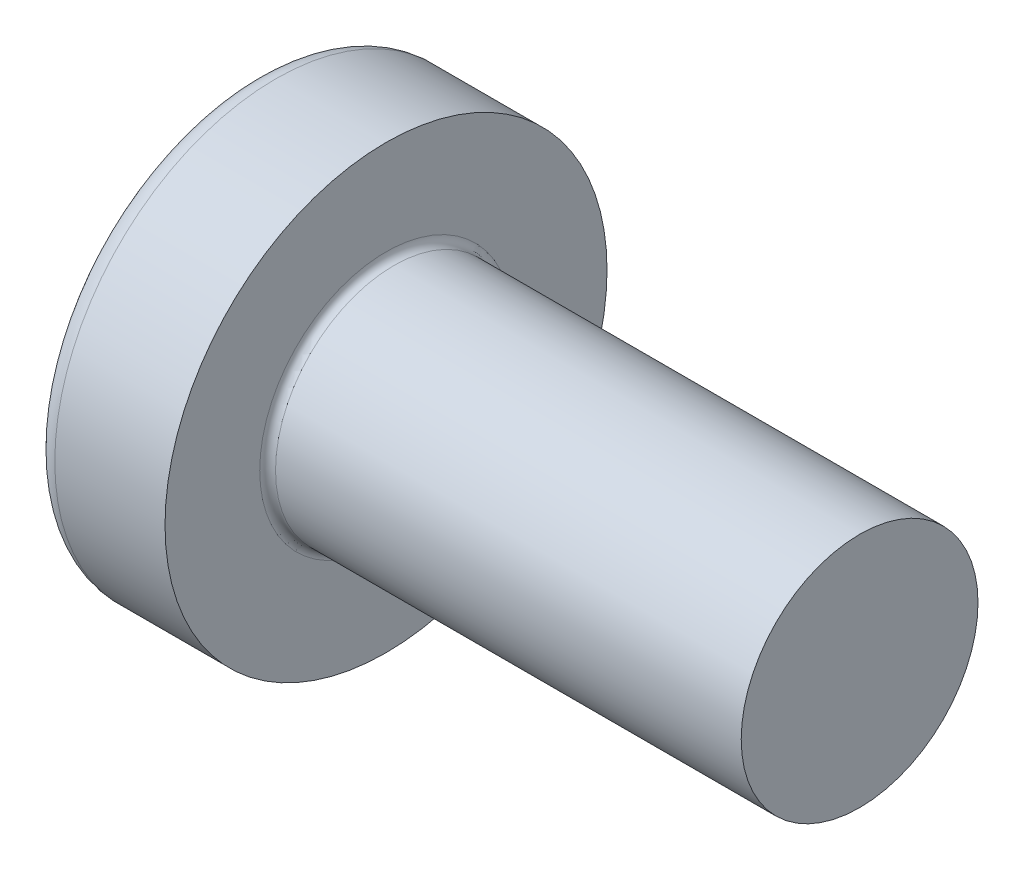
ISO-10303-21;
HEADER;
FILE_DESCRIPTION(('STEP AP214'),'2;1');
FILE_NAME('part.step','',(''),(''),'','','');
FILE_SCHEMA(('AUTOMOTIVE_DESIGN { 1 0 10303 214 1 1 1 1 }'));
ENDSEC;
DATA;
#1=APPLICATION_CONTEXT('core data for automotive mechanical design processes');
#2=APPLICATION_PROTOCOL_DEFINITION('international standard','automotive_design',2000,#1);
#3=PRODUCT_CONTEXT('',#1,'mechanical');
#4=PRODUCT('Part','Part','',(#3));
#5=PRODUCT_RELATED_PRODUCT_CATEGORY('part','',(#4));
#6=PRODUCT_DEFINITION_FORMATION('','',#4);
#7=PRODUCT_DEFINITION_CONTEXT('part definition',#1,'design');
#8=PRODUCT_DEFINITION('design','',#6,#7);
#9=PRODUCT_DEFINITION_SHAPE('','',#8);
#10=(LENGTH_UNIT() NAMED_UNIT(*) SI_UNIT(.MILLI.,.METRE.));
#11=(NAMED_UNIT(*) PLANE_ANGLE_UNIT() SI_UNIT($,.RADIAN.));
#12=(NAMED_UNIT(*) SI_UNIT($,.STERADIAN.) SOLID_ANGLE_UNIT());
#13=UNCERTAINTY_MEASURE_WITH_UNIT(LENGTH_MEASURE(1.E-05),#10,'distance_accuracy_value','');
#14=(GEOMETRIC_REPRESENTATION_CONTEXT(3) GLOBAL_UNCERTAINTY_ASSIGNED_CONTEXT((#13)) GLOBAL_UNIT_ASSIGNED_CONTEXT((#10,
#11,#12)) REPRESENTATION_CONTEXT('',''));
#15=CARTESIAN_POINT('',(0.,0.,0.));
#16=DIRECTION('',(0.,0.,1.));
#17=DIRECTION('',(1.,0.,0.));
#18=AXIS2_PLACEMENT_3D('',#15,#16,#17);
#19=CARTESIAN_POINT('',(5.,0.,0.));
#20=DIRECTION('',(-1.,0.,0.));
#21=DIRECTION('',(0.,1.,0.));
#22=AXIS2_PLACEMENT_3D('',#19,#20,#21);
#23=SPHERICAL_SURFACE('',#22,5.);
#24=CARTESIAN_POINT('',(0.775371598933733,0.,0.));
#25=DIRECTION('',(-1.,0.,0.));
#26=DIRECTION('',(0.,0.,1.));
#27=AXIS2_PLACEMENT_3D('',#24,#25,#26);
#28=CIRCLE('',#27,2.67441860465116);
#29=CARTESIAN_POINT('',(0.775371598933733,0.,2.67441860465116));
#30=VERTEX_POINT('',#29);
#31=EDGE_CURVE('E237',#30,#30,#28,.T.);
#32=ORIENTED_EDGE('',*,*,#31,.T.);
#33=EDGE_LOOP('',(#32));
#34=FACE_BOUND('',#33,.T.);
#35=CARTESIAN_POINT('',(0.0457951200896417,0.,0.));
#36=DIRECTION('',(1.,0.,0.));
#37=DIRECTION('',(0.,0.,-1.));
#38=AXIS2_PLACEMENT_3D('',#35,#36,#37);
#39=CIRCLE('',#38,0.675169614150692);
#40=CARTESIAN_POINT('',(0.0457951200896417,-0.369999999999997,-0.564760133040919));
#41=VERTEX_POINT('',#40);
#42=CARTESIAN_POINT('',(0.0457951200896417,-0.564760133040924,-0.37));
#43=VERTEX_POINT('',#42);
#44=EDGE_CURVE('E373',#41,#43,#39,.F.);
#45=ORIENTED_EDGE('',*,*,#44,.F.);
#46=CARTESIAN_POINT('',(5.,-0.370000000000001,0.));
#47=DIRECTION('',(0.,1.,0.));
#48=DIRECTION('',(0.,0.,1.));
#49=AXIS2_PLACEMENT_3D('',#46,#47,#48);
#50=CIRCLE('',#49,4.98629120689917);
#51=CARTESIAN_POINT('',(0.187869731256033,-0.369999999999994,-1.30633161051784));
#52=VERTEX_POINT('',#51);
#53=EDGE_CURVE('E299',#52,#41,#50,.T.);
#54=ORIENTED_EDGE('',*,*,#53,.F.);
#55=CARTESIAN_POINT('',(4.56358245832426,0.,0.87531820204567));
#56=DIRECTION('',(0.446197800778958,0.,-0.89493436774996));
#57=DIRECTION('',(-0.89493436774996,0.,-0.446197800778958));
#58=AXIS2_PLACEMENT_3D('',#55,#56,#57);
#59=CIRCLE('',#58,4.90340267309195);
#60=CARTESIAN_POINT('',(0.187869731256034,0.370000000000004,-1.30633161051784));
#61=VERTEX_POINT('',#60);
#62=EDGE_CURVE('E271',#52,#61,#59,.T.);
#63=ORIENTED_EDGE('',*,*,#62,.T.);
#64=CARTESIAN_POINT('',(5.,0.37,0.));
#65=DIRECTION('',(0.,-1.,0.));
#66=DIRECTION('',(0.,0.,-1.));
#67=AXIS2_PLACEMENT_3D('',#64,#65,#66);
#68=CIRCLE('',#67,4.98629120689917);
#69=CARTESIAN_POINT('',(0.0457951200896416,0.370000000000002,-0.564760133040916));
#70=VERTEX_POINT('',#69);
#71=EDGE_CURVE('E326',#70,#61,#68,.T.);
#72=ORIENTED_EDGE('',*,*,#71,.F.);
#73=CARTESIAN_POINT('',(0.0457951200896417,0.564760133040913,-0.37));
#74=VERTEX_POINT('',#73);
#75=EDGE_CURVE('E392',#74,#70,#39,.F.);
#76=ORIENTED_EDGE('',*,*,#75,.F.);
#77=CARTESIAN_POINT('',(5.,0.,-0.37));
#78=DIRECTION('',(0.,0.,1.));
#79=DIRECTION('',(0.,-1.,0.));
#80=AXIS2_PLACEMENT_3D('',#77,#78,#79);
#81=CIRCLE('',#80,4.98629120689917);
#82=CARTESIAN_POINT('',(0.187869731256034,1.30633161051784,-0.37));
#83=VERTEX_POINT('',#82);
#84=EDGE_CURVE('E265',#83,#74,#81,.T.);
#85=ORIENTED_EDGE('',*,*,#84,.F.);
#86=CARTESIAN_POINT('',(4.56358245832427,-0.87531820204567,0.));
#87=DIRECTION('',(0.446197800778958,0.89493436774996,0.));
#88=DIRECTION('',(-0.89493436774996,0.446197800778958,0.));
#89=AXIS2_PLACEMENT_3D('',#86,#87,#88);
#90=CIRCLE('',#89,4.90340267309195);
#91=CARTESIAN_POINT('',(0.187869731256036,1.30633161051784,0.37));
#92=VERTEX_POINT('',#91);
#93=EDGE_CURVE('E268',#83,#92,#90,.T.);
#94=ORIENTED_EDGE('',*,*,#93,.T.);
#95=CARTESIAN_POINT('',(5.,0.,0.370000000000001));
#96=DIRECTION('',(0.,0.,-1.));
#97=DIRECTION('',(-1.,0.,0.));
#98=AXIS2_PLACEMENT_3D('',#95,#96,#97);
#99=CIRCLE('',#98,4.98629120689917);
#100=CARTESIAN_POINT('',(0.0457951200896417,0.564760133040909,0.369999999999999));
#101=VERTEX_POINT('',#100);
#102=EDGE_CURVE('E261',#101,#92,#99,.T.);
#103=ORIENTED_EDGE('',*,*,#102,.F.);
#104=CARTESIAN_POINT('',(0.0457951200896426,0.369999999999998,0.564760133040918));
#105=VERTEX_POINT('',#104);
#106=EDGE_CURVE('E391',#105,#101,#39,.F.);
#107=ORIENTED_EDGE('',*,*,#106,.F.);
#108=CARTESIAN_POINT('',(0.187869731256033,0.369999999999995,1.30633161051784));
#109=VERTEX_POINT('',#108);
#110=EDGE_CURVE('E281',#109,#105,#68,.T.);
#111=ORIENTED_EDGE('',*,*,#110,.F.);
#112=CARTESIAN_POINT('',(4.56358245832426,0.,-0.875318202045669));
#113=DIRECTION('',(0.446197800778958,0.,0.89493436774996));
#114=DIRECTION('',(0.89493436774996,0.,-0.446197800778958));
#115=AXIS2_PLACEMENT_3D('',#112,#113,#114);
#116=CIRCLE('',#115,4.90340267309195);
#117=CARTESIAN_POINT('',(0.187869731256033,-0.370000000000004,1.30633161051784));
#118=VERTEX_POINT('',#117);
#119=EDGE_CURVE('E48',#109,#118,#116,.T.);
#120=ORIENTED_EDGE('',*,*,#119,.T.);
#121=CARTESIAN_POINT('',(0.0457951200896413,-0.370000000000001,0.564760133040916));
#122=VERTEX_POINT('',#121);
#123=EDGE_CURVE('E278',#122,#118,#50,.T.);
#124=ORIENTED_EDGE('',*,*,#123,.F.);
#125=CARTESIAN_POINT('',(0.0457951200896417,-0.56476013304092,0.369999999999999));
#126=VERTEX_POINT('',#125);
#127=EDGE_CURVE('E431',#126,#122,#39,.F.);
#128=ORIENTED_EDGE('',*,*,#127,.F.);
#129=CARTESIAN_POINT('',(0.187869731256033,-1.30633161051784,0.369999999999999));
#130=VERTEX_POINT('',#129);
#131=EDGE_CURVE('E262',#130,#126,#99,.T.);
#132=ORIENTED_EDGE('',*,*,#131,.F.);
#133=CARTESIAN_POINT('',(4.56358245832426,0.875318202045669,0.));
#134=DIRECTION('',(0.446197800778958,-0.89493436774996,0.));
#135=DIRECTION('',(0.89493436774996,0.446197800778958,0.));
#136=AXIS2_PLACEMENT_3D('',#133,#134,#135);
#137=CIRCLE('',#136,4.90340267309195);
#138=CARTESIAN_POINT('',(0.187869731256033,-1.30633161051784,-0.37));
#139=VERTEX_POINT('',#138);
#140=EDGE_CURVE('E258',#130,#139,#137,.T.);
#141=ORIENTED_EDGE('',*,*,#140,.T.);
#142=EDGE_CURVE('E63',#43,#139,#81,.T.);
#143=ORIENTED_EDGE('',*,*,#142,.F.);
#144=EDGE_LOOP('',(#45,#54,#63,#72,#76,#85,#94,#103,#107,#111,#120,#124,#128,#132,#141,#143));
#145=FACE_BOUND('',#144,.T.);
#146=ADVANCED_FACE('F34',(#34,#145),#23,.T.);
#147=CARTESIAN_POINT('',(1.75,0.527482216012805,-0.37));
#148=DIRECTION('',(0.,0.,1.));
#149=DIRECTION('',(0.,-1.,0.));
#150=AXIS2_PLACEMENT_3D('',#147,#148,#149);
#151=PLANE('',#150);
#152=ORIENTED_EDGE('',*,*,#84,.T.);
#153=CARTESIAN_POINT('',(-0.987293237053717,0.649401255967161,-0.37));
#154=CARTESIAN_POINT('',(-0.781914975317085,0.632865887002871,-0.37));
#155=CARTESIAN_POINT('',(-0.576547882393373,0.616188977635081,-0.37));
#156=CARTESIAN_POINT('',(-0.165841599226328,0.582441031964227,-0.37));
#157=CARTESIAN_POINT('',(0.0394975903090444,0.56536998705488,-0.37));
#158=CARTESIAN_POINT('',(0.450133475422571,0.530723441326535,-0.37));
#159=CARTESIAN_POINT('',(0.655430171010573,0.513147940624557,-0.37));
#160=CARTESIAN_POINT('',(1.06596140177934,0.477314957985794,-0.37));
#161=CARTESIAN_POINT('',(1.2711959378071,0.459057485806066,-0.37));
#162=CARTESIAN_POINT('',(1.61065292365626,0.428051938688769,-0.37));
#163=CARTESIAN_POINT('',(1.74490059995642,0.415580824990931,-0.37));
#164=CARTESIAN_POINT('',(2.01334321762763,0.390092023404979,-0.37));
#165=CARTESIAN_POINT('',(2.14753815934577,0.377074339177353,-0.37));
#166=CARTESIAN_POINT('',(2.41586354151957,0.350315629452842,-0.37));
#167=CARTESIAN_POINT('',(2.5499939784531,0.33657456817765,-0.37));
#168=CARTESIAN_POINT('',(2.81814173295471,0.308004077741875,-0.37));
#169=CARTESIAN_POINT('',(2.95215904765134,0.293174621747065,-0.37));
#170=CARTESIAN_POINT('',(3.0860955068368,0.277618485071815,-0.37));
#171=B_SPLINE_CURVE_WITH_KNOTS('',3,(#153,#154,#155,#156,#157,#158,#159,#160,#161,#162,#163,
#164,#165,#166,#167,#168,#169,#170),.UNSPECIFIED.,.F.,.F.,(4,2,2,2,2,2,2,2,4),(0.,
0.618128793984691,1.23627109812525,1.85441325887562,2.4725465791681,2.87702276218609,
3.28149623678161,3.68598973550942,4.09049321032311),.UNSPECIFIED.);
#172=CARTESIAN_POINT('',(1.75,0.415013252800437,-0.370000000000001));
#173=VERTEX_POINT('',#172);
#174=EDGE_CURVE('E415',#74,#173,#171,.T.);
#175=ORIENTED_EDGE('',*,*,#174,.T.);
#176=DIRECTION('',(0.,1.,0.));
#177=VECTOR('',#176,1.);
#178=CARTESIAN_POINT('',(1.75,-0.527482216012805,-0.37));
#179=LINE('',#178,#177);
#180=CARTESIAN_POINT('',(1.75,0.527482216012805,-0.37));
#181=VERTEX_POINT('',#180);
#182=EDGE_CURVE('E355',#173,#181,#179,.T.);
#183=ORIENTED_EDGE('',*,*,#182,.T.);
#184=DIRECTION('',(0.89493436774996,-0.446197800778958,0.));
#185=VECTOR('',#184,1.);
#186=CARTESIAN_POINT('',(0.,1.4,-0.37));
#187=LINE('',#186,#185);
#188=EDGE_CURVE('E238',#83,#181,#187,.T.);
#189=ORIENTED_EDGE('',*,*,#188,.F.);
#190=EDGE_LOOP('',(#152,#175,#183,#189));
#191=FACE_BOUND('',#190,.T.);
#192=ADVANCED_FACE('F193',(#191),#151,.T.);
#193=CARTESIAN_POINT('',(1.75,-0.527482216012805,-0.37));
#194=VERTEX_POINT('',#193);
#195=CARTESIAN_POINT('',(1.75,-0.415013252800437,-0.37));
#196=VERTEX_POINT('',#195);
#197=EDGE_CURVE('E246',#194,#196,#179,.T.);
#198=ORIENTED_EDGE('',*,*,#197,.T.);
#199=CARTESIAN_POINT('',(-0.987293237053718,-0.649401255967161,-0.37));
#200=CARTESIAN_POINT('',(-0.781914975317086,-0.632865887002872,-0.37));
#201=CARTESIAN_POINT('',(-0.576547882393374,-0.616188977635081,-0.37));
#202=CARTESIAN_POINT('',(-0.165841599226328,-0.582441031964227,-0.37));
#203=CARTESIAN_POINT('',(0.0394975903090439,-0.56536998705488,-0.37));
#204=CARTESIAN_POINT('',(0.450133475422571,-0.530723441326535,-0.37));
#205=CARTESIAN_POINT('',(0.655430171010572,-0.513147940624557,-0.37));
#206=CARTESIAN_POINT('',(1.06596140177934,-0.477314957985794,-0.37));
#207=CARTESIAN_POINT('',(1.2711959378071,-0.459057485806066,-0.37));
#208=CARTESIAN_POINT('',(1.61065292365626,-0.428051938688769,-0.37));
#209=CARTESIAN_POINT('',(1.74490059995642,-0.415580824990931,-0.37));
#210=CARTESIAN_POINT('',(2.01334321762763,-0.39009202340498,-0.37));
#211=CARTESIAN_POINT('',(2.14753815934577,-0.377074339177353,-0.37));
#212=CARTESIAN_POINT('',(2.41586354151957,-0.350315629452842,-0.37));
#213=CARTESIAN_POINT('',(2.5499939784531,-0.33657456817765,-0.37));
#214=CARTESIAN_POINT('',(2.81814173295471,-0.308004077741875,-0.37));
#215=CARTESIAN_POINT('',(2.95215904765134,-0.293174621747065,-0.37));
#216=CARTESIAN_POINT('',(3.0860955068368,-0.277618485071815,-0.37));
#217=B_SPLINE_CURVE_WITH_KNOTS('',3,(#199,#200,#201,#202,#203,#204,#205,#206,#207,#208,#209,
#210,#211,#212,#213,#214,#215,#216),.UNSPECIFIED.,.F.,.F.,(4,2,2,2,2,2,2,2,4),(0.,
0.618128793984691,1.23627109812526,1.85441325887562,2.4725465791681,2.87702276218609,
3.28149623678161,3.68598973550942,4.09049321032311),.UNSPECIFIED.);
#218=EDGE_CURVE('E390',#196,#43,#217,.F.);
#219=ORIENTED_EDGE('',*,*,#218,.T.);
#220=ORIENTED_EDGE('',*,*,#142,.T.);
#221=DIRECTION('',(0.89493436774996,0.446197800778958,0.));
#222=VECTOR('',#221,1.);
#223=CARTESIAN_POINT('',(0.,-1.4,-0.37));
#224=LINE('',#223,#222);
#225=EDGE_CURVE('E329',#139,#194,#224,.T.);
#226=ORIENTED_EDGE('',*,*,#225,.T.);
#227=EDGE_LOOP('',(#198,#219,#220,#226));
#228=FACE_BOUND('',#227,.T.);
#229=ADVANCED_FACE('F199',(#228),#151,.T.);
#230=CARTESIAN_POINT('',(1.75,-0.527482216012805,0.37));
#231=DIRECTION('',(0.,0.,-1.));
#232=DIRECTION('',(-1.,0.,0.));
#233=AXIS2_PLACEMENT_3D('',#230,#231,#232);
#234=PLANE('',#233);
#235=DIRECTION('',(0.,-1.,0.));
#236=VECTOR('',#235,1.);
#237=CARTESIAN_POINT('',(1.75,0.527482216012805,0.37));
#238=LINE('',#237,#236);
#239=CARTESIAN_POINT('',(1.75,0.527482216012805,0.37));
#240=VERTEX_POINT('',#239);
#241=CARTESIAN_POINT('',(1.75,0.415013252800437,0.37));
#242=VERTEX_POINT('',#241);
#243=EDGE_CURVE('E338',#240,#242,#238,.T.);
#244=ORIENTED_EDGE('',*,*,#243,.T.);
#245=CARTESIAN_POINT('',(-0.987293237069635,0.649401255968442,0.369999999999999));
#246=CARTESIAN_POINT('',(-0.781914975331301,0.632865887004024,0.369999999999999));
#247=CARTESIAN_POINT('',(-0.576547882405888,0.616188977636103,0.369999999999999));
#248=CARTESIAN_POINT('',(-0.165841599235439,0.582441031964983,0.369999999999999));
#249=CARTESIAN_POINT('',(0.039497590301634,0.5653699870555,0.369999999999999));
#250=CARTESIAN_POINT('',(0.450133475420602,0.530723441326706,0.37));
#251=CARTESIAN_POINT('',(0.655430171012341,0.513147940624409,0.37));
#252=CARTESIAN_POINT('',(1.06596140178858,0.477314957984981,0.37));
#253=CARTESIAN_POINT('',(1.27119593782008,0.459057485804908,0.37));
#254=CARTESIAN_POINT('',(1.61065292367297,0.428051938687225,0.37));
#255=CARTESIAN_POINT('',(1.74490059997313,0.415580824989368,0.37));
#256=CARTESIAN_POINT('',(2.01334321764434,0.390092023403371,0.37));
#257=CARTESIAN_POINT('',(2.14753815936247,0.377074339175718,0.37));
#258=CARTESIAN_POINT('',(2.41586354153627,0.350315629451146,0.37));
#259=CARTESIAN_POINT('',(2.54999397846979,0.336574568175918,0.37));
#260=CARTESIAN_POINT('',(2.8181417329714,0.308004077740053,0.37));
#261=CARTESIAN_POINT('',(2.95215904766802,0.293174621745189,0.37));
#262=CARTESIAN_POINT('',(3.08609550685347,0.277618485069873,0.37));
#263=B_SPLINE_CURVE_WITH_KNOTS('',3,(#245,#246,#247,#248,#249,#250,#251,#252,#253,#254,#255,
#256,#257,#258,#259,#260,#261,#262),.UNSPECIFIED.,.F.,.F.,(4,2,2,2,2,2,2,2,4),(0.,
0.618128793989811,1.23627109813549,1.85441325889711,2.47254657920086,2.87702276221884,
3.28149623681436,3.68598973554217,4.09049321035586),.UNSPECIFIED.);
#264=EDGE_CURVE('E670',#242,#101,#263,.F.);
#265=ORIENTED_EDGE('',*,*,#264,.T.);
#266=ORIENTED_EDGE('',*,*,#102,.T.);
#267=DIRECTION('',(0.89493436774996,-0.446197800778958,0.));
#268=VECTOR('',#267,1.);
#269=CARTESIAN_POINT('',(0.,1.4,0.37));
#270=LINE('',#269,#268);
#271=EDGE_CURVE('E243',#92,#240,#270,.T.);
#272=ORIENTED_EDGE('',*,*,#271,.T.);
#273=EDGE_LOOP('',(#244,#265,#266,#272));
#274=FACE_BOUND('',#273,.T.);
#275=ADVANCED_FACE('F411',(#274),#234,.T.);
#276=ORIENTED_EDGE('',*,*,#131,.T.);
#277=CARTESIAN_POINT('',(-0.987293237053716,-0.649401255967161,0.369999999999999));
#278=CARTESIAN_POINT('',(-0.781914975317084,-0.632865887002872,0.369999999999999));
#279=CARTESIAN_POINT('',(-0.576547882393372,-0.616188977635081,0.369999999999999));
#280=CARTESIAN_POINT('',(-0.165841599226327,-0.582441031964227,0.369999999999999));
#281=CARTESIAN_POINT('',(0.0394975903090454,-0.56536998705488,0.369999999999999));
#282=CARTESIAN_POINT('',(0.450133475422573,-0.530723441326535,0.369999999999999));
#283=CARTESIAN_POINT('',(0.655430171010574,-0.513147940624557,0.369999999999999));
#284=CARTESIAN_POINT('',(1.06596140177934,-0.477314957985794,0.369999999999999));
#285=CARTESIAN_POINT('',(1.2711959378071,-0.459057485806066,0.37));
#286=CARTESIAN_POINT('',(1.61065292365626,-0.428051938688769,0.37));
#287=CARTESIAN_POINT('',(1.74490059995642,-0.415580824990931,0.37));
#288=CARTESIAN_POINT('',(2.01334321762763,-0.39009202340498,0.37));
#289=CARTESIAN_POINT('',(2.14753815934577,-0.377074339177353,0.37));
#290=CARTESIAN_POINT('',(2.41586354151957,-0.350315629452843,0.37));
#291=CARTESIAN_POINT('',(2.5499939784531,-0.33657456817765,0.37));
#292=CARTESIAN_POINT('',(2.81814173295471,-0.308004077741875,0.37));
#293=CARTESIAN_POINT('',(2.95215904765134,-0.293174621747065,0.37));
#294=CARTESIAN_POINT('',(3.0860955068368,-0.277618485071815,0.37));
#295=B_SPLINE_CURVE_WITH_KNOTS('',3,(#277,#278,#279,#280,#281,#282,#283,#284,#285,#286,#287,
#288,#289,#290,#291,#292,#293,#294),.UNSPECIFIED.,.F.,.F.,(4,2,2,2,2,2,2,2,4),(0.,
0.618128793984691,1.23627109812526,1.85441325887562,2.4725465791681,2.87702276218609,
3.28149623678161,3.68598973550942,4.09049321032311),.UNSPECIFIED.);
#296=CARTESIAN_POINT('',(1.75,-0.415013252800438,0.37));
#297=VERTEX_POINT('',#296);
#298=EDGE_CURVE('E432',#126,#297,#295,.T.);
#299=ORIENTED_EDGE('',*,*,#298,.T.);
#300=CARTESIAN_POINT('',(1.75,-0.527482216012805,0.37));
#301=VERTEX_POINT('',#300);
#302=EDGE_CURVE('E340',#297,#301,#238,.T.);
#303=ORIENTED_EDGE('',*,*,#302,.T.);
#304=DIRECTION('',(0.89493436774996,0.446197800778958,0.));
#305=VECTOR('',#304,1.);
#306=CARTESIAN_POINT('',(0.,-1.4,0.369999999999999));
#307=LINE('',#306,#305);
#308=EDGE_CURVE('E331',#130,#301,#307,.T.);
#309=ORIENTED_EDGE('',*,*,#308,.F.);
#310=EDGE_LOOP('',(#276,#299,#303,#309));
#311=FACE_BOUND('',#310,.T.);
#312=ADVANCED_FACE('F524',(#311),#234,.T.);
#313=CARTESIAN_POINT('',(1.75,0.527482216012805,0.37));
#314=DIRECTION('',(0.446197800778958,0.89493436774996,0.));
#315=DIRECTION('',(-0.89493436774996,0.446197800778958,0.));
#316=AXIS2_PLACEMENT_3D('',#313,#314,#315);
#317=PLANE('',#316);
#318=CARTESIAN_POINT('',(2.66965234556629,0.0689604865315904,0.));
#319=DIRECTION('',(0.446197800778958,0.89493436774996,0.));
#320=DIRECTION('',(-0.89493436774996,0.446197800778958,0.));
#321=AXIS2_PLACEMENT_3D('',#318,#319,#320);
#322=ELLIPSE('',#321,1.10195891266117,0.486831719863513);
#323=CARTESIAN_POINT('',(1.75,0.527482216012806,0.175779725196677));
#324=VERTEX_POINT('',#323);
#325=CARTESIAN_POINT('',(1.75,0.527482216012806,-0.175779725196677));
#326=VERTEX_POINT('',#325);
#327=EDGE_CURVE('E304',#324,#326,#322,.F.);
#328=ORIENTED_EDGE('',*,*,#327,.F.);
#329=DIRECTION('',(0.,0.,-1.));
#330=VECTOR('',#329,1.);
#331=CARTESIAN_POINT('',(1.75,0.527482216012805,0.37));
#332=LINE('',#331,#330);
#333=EDGE_CURVE('E341',#240,#324,#332,.T.);
#334=ORIENTED_EDGE('',*,*,#333,.F.);
#335=ORIENTED_EDGE('',*,*,#271,.F.);
#336=ORIENTED_EDGE('',*,*,#93,.F.);
#337=ORIENTED_EDGE('',*,*,#188,.T.);
#338=EDGE_CURVE('E343',#326,#181,#332,.T.);
#339=ORIENTED_EDGE('',*,*,#338,.F.);
#340=EDGE_LOOP('',(#328,#334,#335,#336,#337,#339));
#341=FACE_BOUND('',#340,.T.);
#342=ADVANCED_FACE('F409',(#341),#317,.F.);
#343=CARTESIAN_POINT('',(0.,-1.4,-0.37));
#344=DIRECTION('',(0.446197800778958,-0.89493436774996,0.));
#345=DIRECTION('',(0.89493436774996,0.446197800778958,0.));
#346=AXIS2_PLACEMENT_3D('',#343,#344,#345);
#347=PLANE('',#346);
#348=CARTESIAN_POINT('',(2.66965234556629,-0.0689604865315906,0.));
#349=DIRECTION('',(0.446197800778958,-0.89493436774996,0.));
#350=DIRECTION('',(-0.89493436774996,-0.446197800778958,0.));
#351=AXIS2_PLACEMENT_3D('',#348,#349,#350);
#352=ELLIPSE('',#351,1.10195891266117,0.486831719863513);
#353=CARTESIAN_POINT('',(1.75,-0.527482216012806,-0.175779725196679));
#354=VERTEX_POINT('',#353);
#355=CARTESIAN_POINT('',(1.75,-0.527482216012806,0.175779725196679));
#356=VERTEX_POINT('',#355);
#357=EDGE_CURVE('E672',#354,#356,#352,.F.);
#358=ORIENTED_EDGE('',*,*,#357,.F.);
#359=DIRECTION('',(0.,0.,1.));
#360=VECTOR('',#359,1.);
#361=CARTESIAN_POINT('',(1.75,-0.527482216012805,-0.37));
#362=LINE('',#361,#360);
#363=EDGE_CURVE('E334',#194,#354,#362,.T.);
#364=ORIENTED_EDGE('',*,*,#363,.F.);
#365=ORIENTED_EDGE('',*,*,#225,.F.);
#366=ORIENTED_EDGE('',*,*,#140,.F.);
#367=ORIENTED_EDGE('',*,*,#308,.T.);
#368=EDGE_CURVE('E337',#356,#301,#362,.T.);
#369=ORIENTED_EDGE('',*,*,#368,.F.);
#370=EDGE_LOOP('',(#358,#364,#365,#366,#367,#369));
#371=FACE_BOUND('',#370,.T.);
#372=ADVANCED_FACE('F511',(#371),#347,.F.);
#373=CARTESIAN_POINT('',(1.75,0.527482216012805,-0.37));
#374=DIRECTION('',(-1.,0.,0.));
#375=DIRECTION('',(0.,0.,1.));
#376=AXIS2_PLACEMENT_3D('',#373,#374,#375);
#377=PLANE('',#376);
#378=DIRECTION('',(0.,1.,0.));
#379=VECTOR('',#378,1.);
#380=CARTESIAN_POINT('',(1.75,-0.370000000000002,0.527482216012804));
#381=LINE('',#380,#379);
#382=CARTESIAN_POINT('',(1.75,-0.370000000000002,0.527482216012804));
#383=VERTEX_POINT('',#382);
#384=CARTESIAN_POINT('',(1.75,-0.175779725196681,0.527482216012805));
#385=VERTEX_POINT('',#384);
#386=EDGE_CURVE('E319',#383,#385,#381,.T.);
#387=ORIENTED_EDGE('',*,*,#386,.T.);
#388=CARTESIAN_POINT('',(1.75,0.,0.));
#389=DIRECTION('',(-1.,0.,0.));
#390=DIRECTION('',(0.,0.,1.));
#391=AXIS2_PLACEMENT_3D('',#388,#389,#390);
#392=CIRCLE('',#391,0.556);
#393=CARTESIAN_POINT('',(1.75,-0.370000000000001,0.415013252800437));
#394=VERTEX_POINT('',#393);
#395=EDGE_CURVE('E700',#394,#385,#392,.T.);
#396=ORIENTED_EDGE('',*,*,#395,.F.);
#397=DIRECTION('',(0.,0.,-1.));
#398=VECTOR('',#397,1.);
#399=CARTESIAN_POINT('',(1.75,-0.370000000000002,0.527482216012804));
#400=LINE('',#399,#398);
#401=EDGE_CURVE('E315',#383,#394,#400,.T.);
#402=ORIENTED_EDGE('',*,*,#401,.F.);
#403=EDGE_LOOP('',(#387,#396,#402));
#404=FACE_BOUND('',#403,.T.);
#405=ADVANCED_FACE('F468',(#404),#377,.T.);
#406=ORIENTED_EDGE('',*,*,#302,.F.);
#407=EDGE_CURVE('E705',#356,#297,#392,.T.);
#408=ORIENTED_EDGE('',*,*,#407,.F.);
#409=ORIENTED_EDGE('',*,*,#368,.T.);
#410=EDGE_LOOP('',(#406,#408,#409));
#411=FACE_BOUND('',#410,.T.);
#412=ADVANCED_FACE('F498',(#411),#377,.T.);
#413=ORIENTED_EDGE('',*,*,#363,.T.);
#414=EDGE_CURVE('E384',#196,#354,#392,.T.);
#415=ORIENTED_EDGE('',*,*,#414,.F.);
#416=ORIENTED_EDGE('',*,*,#197,.F.);
#417=EDGE_LOOP('',(#413,#415,#416));
#418=FACE_BOUND('',#417,.T.);
#419=ADVANCED_FACE('F492',(#418),#377,.T.);
#420=CARTESIAN_POINT('',(1.75,-0.369999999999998,-0.415013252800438));
#421=VERTEX_POINT('',#420);
#422=CARTESIAN_POINT('',(1.75,-0.369999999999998,-0.527482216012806));
#423=VERTEX_POINT('',#422);
#424=EDGE_CURVE('E318',#421,#423,#400,.T.);
#425=ORIENTED_EDGE('',*,*,#424,.F.);
#426=CARTESIAN_POINT('',(1.75,-0.175779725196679,-0.527482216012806));
#427=VERTEX_POINT('',#426);
#428=EDGE_CURVE('E55',#427,#421,#392,.T.);
#429=ORIENTED_EDGE('',*,*,#428,.F.);
#430=DIRECTION('',(0.,-1.,0.));
#431=VECTOR('',#430,1.);
#432=CARTESIAN_POINT('',(1.75,0.370000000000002,-0.527482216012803));
#433=LINE('',#432,#431);
#434=EDGE_CURVE('E314',#427,#423,#433,.T.);
#435=ORIENTED_EDGE('',*,*,#434,.T.);
#436=EDGE_LOOP('',(#425,#429,#435));
#437=FACE_BOUND('',#436,.T.);
#438=ADVANCED_FACE('F379',(#437),#377,.T.);
#439=CARTESIAN_POINT('',(1.75,0.370000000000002,-0.527482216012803));
#440=VERTEX_POINT('',#439);
#441=CARTESIAN_POINT('',(1.75,0.175779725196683,-0.527482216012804));
#442=VERTEX_POINT('',#441);
#443=EDGE_CURVE('E311',#440,#442,#433,.T.);
#444=ORIENTED_EDGE('',*,*,#443,.T.);
#445=CARTESIAN_POINT('',(1.75,0.370000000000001,-0.415013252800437));
#446=VERTEX_POINT('',#445);
#447=EDGE_CURVE('E383',#446,#442,#392,.T.);
#448=ORIENTED_EDGE('',*,*,#447,.F.);
#449=DIRECTION('',(0.,0.,1.));
#450=VECTOR('',#449,1.);
#451=CARTESIAN_POINT('',(1.75,0.370000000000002,-0.527482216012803));
#452=LINE('',#451,#450);
#453=EDGE_CURVE('E323',#440,#446,#452,.T.);
#454=ORIENTED_EDGE('',*,*,#453,.F.);
#455=EDGE_LOOP('',(#444,#448,#454));
#456=FACE_BOUND('',#455,.T.);
#457=ADVANCED_FACE('F480',(#456),#377,.T.);
#458=ORIENTED_EDGE('',*,*,#182,.F.);
#459=EDGE_CURVE('E689',#326,#173,#392,.T.);
#460=ORIENTED_EDGE('',*,*,#459,.F.);
#461=ORIENTED_EDGE('',*,*,#338,.T.);
#462=EDGE_LOOP('',(#458,#460,#461));
#463=FACE_BOUND('',#462,.T.);
#464=ADVANCED_FACE('F474',(#463),#377,.T.);
#465=ORIENTED_EDGE('',*,*,#333,.T.);
#466=EDGE_CURVE('E691',#242,#324,#392,.T.);
#467=ORIENTED_EDGE('',*,*,#466,.F.);
#468=ORIENTED_EDGE('',*,*,#243,.F.);
#469=EDGE_LOOP('',(#465,#467,#468));
#470=FACE_BOUND('',#469,.T.);
#471=ADVANCED_FACE('F466',(#470),#377,.T.);
#472=CARTESIAN_POINT('',(1.75,0.369999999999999,0.415013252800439));
#473=VERTEX_POINT('',#472);
#474=CARTESIAN_POINT('',(1.75,0.369999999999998,0.527482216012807));
#475=VERTEX_POINT('',#474);
#476=EDGE_CURVE('E296',#473,#475,#452,.T.);
#477=ORIENTED_EDGE('',*,*,#476,.F.);
#478=CARTESIAN_POINT('',(1.75,0.175779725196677,0.527482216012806));
#479=VERTEX_POINT('',#478);
#480=EDGE_CURVE('E385',#479,#473,#392,.T.);
#481=ORIENTED_EDGE('',*,*,#480,.F.);
#482=EDGE_CURVE('E322',#479,#475,#381,.T.);
#483=ORIENTED_EDGE('',*,*,#482,.T.);
#484=EDGE_LOOP('',(#477,#481,#483));
#485=FACE_BOUND('',#484,.T.);
#486=ADVANCED_FACE('F460',(#485),#377,.T.);
#487=CARTESIAN_POINT('',(1.75,0.369999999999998,0.527482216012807));
#488=DIRECTION('',(0.,-1.,0.));
#489=DIRECTION('',(0.,0.,-1.));
#490=AXIS2_PLACEMENT_3D('',#487,#488,#489);
#491=PLANE('',#490);
#492=ORIENTED_EDGE('',*,*,#110,.T.);
#493=CARTESIAN_POINT('',(-0.987293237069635,0.369999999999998,0.649401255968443));
#494=CARTESIAN_POINT('',(-0.781914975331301,0.369999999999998,0.632865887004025));
#495=CARTESIAN_POINT('',(-0.576547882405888,0.369999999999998,0.616188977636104));
#496=CARTESIAN_POINT('',(-0.165841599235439,0.369999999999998,0.582441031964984));
#497=CARTESIAN_POINT('',(0.0394975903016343,0.369999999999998,0.565369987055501));
#498=CARTESIAN_POINT('',(0.450133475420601,0.369999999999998,0.530723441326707));
#499=CARTESIAN_POINT('',(0.655430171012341,0.369999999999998,0.51314794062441));
#500=CARTESIAN_POINT('',(1.06596140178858,0.369999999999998,0.477314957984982));
#501=CARTESIAN_POINT('',(1.27119593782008,0.369999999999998,0.459057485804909));
#502=CARTESIAN_POINT('',(1.61065292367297,0.369999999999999,0.428051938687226));
#503=CARTESIAN_POINT('',(1.74490059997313,0.369999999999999,0.415580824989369));
#504=CARTESIAN_POINT('',(2.01334321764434,0.369999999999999,0.390092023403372));
#505=CARTESIAN_POINT('',(2.14753815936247,0.369999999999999,0.377074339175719));
#506=CARTESIAN_POINT('',(2.41586354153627,0.369999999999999,0.350315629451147));
#507=CARTESIAN_POINT('',(2.54999397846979,0.369999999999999,0.336574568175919));
#508=CARTESIAN_POINT('',(2.8181417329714,0.369999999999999,0.308004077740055));
#509=CARTESIAN_POINT('',(2.95215904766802,0.369999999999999,0.29317462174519));
#510=CARTESIAN_POINT('',(3.08609550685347,0.369999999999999,0.277618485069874));
#511=B_SPLINE_CURVE_WITH_KNOTS('',3,(#493,#494,#495,#496,#497,#498,#499,#500,#501,#502,#503,
#504,#505,#506,#507,#508,#509,#510),.UNSPECIFIED.,.F.,.F.,(4,2,2,2,2,2,2,2,4),(0.,
0.61812879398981,1.2362710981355,1.85441325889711,2.47254657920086,2.87702276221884,
3.28149623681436,3.68598973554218,4.09049321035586),.UNSPECIFIED.);
#512=EDGE_CURVE('E669',#105,#473,#511,.T.);
#513=ORIENTED_EDGE('',*,*,#512,.T.);
#514=ORIENTED_EDGE('',*,*,#476,.T.);
#515=DIRECTION('',(0.89493436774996,0.,-0.446197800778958));
#516=VECTOR('',#515,1.);
#517=CARTESIAN_POINT('',(0.,0.369999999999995,1.4));
#518=LINE('',#517,#516);
#519=EDGE_CURVE('E289',#109,#475,#518,.T.);
#520=ORIENTED_EDGE('',*,*,#519,.F.);
#521=EDGE_LOOP('',(#492,#513,#514,#520));
#522=FACE_BOUND('',#521,.T.);
#523=ADVANCED_FACE('F293',(#522),#491,.T.);
#524=CARTESIAN_POINT('',(1.75,-0.369999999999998,-0.527482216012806));
#525=DIRECTION('',(0.,1.,0.));
#526=DIRECTION('',(-1.,0.,0.));
#527=AXIS2_PLACEMENT_3D('',#524,#525,#526);
#528=PLANE('',#527);
#529=ORIENTED_EDGE('',*,*,#401,.T.);
#530=CARTESIAN_POINT('',(-0.987293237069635,-0.370000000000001,0.649401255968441));
#531=CARTESIAN_POINT('',(-0.781914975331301,-0.370000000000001,0.632865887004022));
#532=CARTESIAN_POINT('',(-0.576547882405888,-0.370000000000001,0.616188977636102));
#533=CARTESIAN_POINT('',(-0.16584159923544,-0.370000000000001,0.582441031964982));
#534=CARTESIAN_POINT('',(0.0394975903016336,-0.370000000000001,0.565369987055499));
#535=CARTESIAN_POINT('',(0.450133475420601,-0.370000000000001,0.530723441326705));
#536=CARTESIAN_POINT('',(0.655430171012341,-0.370000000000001,0.513147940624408));
#537=CARTESIAN_POINT('',(1.06596140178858,-0.370000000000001,0.47731495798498));
#538=CARTESIAN_POINT('',(1.27119593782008,-0.370000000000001,0.459057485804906));
#539=CARTESIAN_POINT('',(1.61065292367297,-0.370000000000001,0.428051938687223));
#540=CARTESIAN_POINT('',(1.74490059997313,-0.370000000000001,0.415580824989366));
#541=CARTESIAN_POINT('',(2.01334321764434,-0.370000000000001,0.390092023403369));
#542=CARTESIAN_POINT('',(2.14753815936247,-0.370000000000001,0.377074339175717));
#543=CARTESIAN_POINT('',(2.41586354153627,-0.370000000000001,0.350315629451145));
#544=CARTESIAN_POINT('',(2.54999397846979,-0.370000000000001,0.336574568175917));
#545=CARTESIAN_POINT('',(2.8181417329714,-0.370000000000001,0.308004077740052));
#546=CARTESIAN_POINT('',(2.95215904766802,-0.370000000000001,0.293174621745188));
#547=CARTESIAN_POINT('',(3.08609550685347,-0.370000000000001,0.277618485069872));
#548=B_SPLINE_CURVE_WITH_KNOTS('',3,(#530,#531,#532,#533,#534,#535,#536,#537,#538,#539,#540,
#541,#542,#543,#544,#545,#546,#547),.UNSPECIFIED.,.F.,.F.,(4,2,2,2,2,2,2,2,4),(0.,
0.61812879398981,1.23627109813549,1.85441325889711,2.47254657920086,2.87702276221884,
3.28149623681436,3.68598973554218,4.09049321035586),.UNSPECIFIED.);
#549=EDGE_CURVE('E424',#394,#122,#548,.F.);
#550=ORIENTED_EDGE('',*,*,#549,.T.);
#551=ORIENTED_EDGE('',*,*,#123,.T.);
#552=DIRECTION('',(0.89493436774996,0.,-0.446197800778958));
#553=VECTOR('',#552,1.);
#554=CARTESIAN_POINT('',(0.,-0.370000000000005,1.4));
#555=LINE('',#554,#553);
#556=EDGE_CURVE('E291',#118,#383,#555,.T.);
#557=ORIENTED_EDGE('',*,*,#556,.T.);
#558=EDGE_LOOP('',(#529,#550,#551,#557));
#559=FACE_BOUND('',#558,.T.);
#560=ADVANCED_FACE('F228',(#559),#528,.T.);
#561=CARTESIAN_POINT('',(1.75,-0.370000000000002,0.527482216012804));
#562=DIRECTION('',(0.446197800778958,0.,0.89493436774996));
#563=DIRECTION('',(-0.89493436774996,0.,0.446197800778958));
#564=AXIS2_PLACEMENT_3D('',#561,#562,#563);
#565=PLANE('',#564);
#566=CARTESIAN_POINT('',(2.66965234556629,0.,0.0689604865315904));
#567=DIRECTION('',(0.446197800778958,0.,0.89493436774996));
#568=DIRECTION('',(-0.89493436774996,0.,0.446197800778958));
#569=AXIS2_PLACEMENT_3D('',#566,#567,#568);
#570=ELLIPSE('',#569,1.10195891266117,0.486831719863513);
#571=EDGE_CURVE('E422',#385,#479,#570,.F.);
#572=ORIENTED_EDGE('',*,*,#571,.F.);
#573=ORIENTED_EDGE('',*,*,#386,.F.);
#574=ORIENTED_EDGE('',*,*,#556,.F.);
#575=ORIENTED_EDGE('',*,*,#119,.F.);
#576=ORIENTED_EDGE('',*,*,#519,.T.);
#577=ORIENTED_EDGE('',*,*,#482,.F.);
#578=EDGE_LOOP('',(#572,#573,#574,#575,#576,#577));
#579=FACE_BOUND('',#578,.T.);
#580=ADVANCED_FACE('F287',(#579),#565,.F.);
#581=CARTESIAN_POINT('',(0.,0.370000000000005,-1.4));
#582=DIRECTION('',(0.446197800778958,0.,-0.89493436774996));
#583=DIRECTION('',(0.89493436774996,0.,0.446197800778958));
#584=AXIS2_PLACEMENT_3D('',#581,#582,#583);
#585=PLANE('',#584);
#586=CARTESIAN_POINT('',(2.66965234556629,0.,-0.0689604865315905));
#587=DIRECTION('',(0.446197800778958,0.,-0.89493436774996));
#588=DIRECTION('',(-0.89493436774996,0.,-0.446197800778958));
#589=AXIS2_PLACEMENT_3D('',#586,#587,#588);
#590=ELLIPSE('',#589,1.10195891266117,0.486831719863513);
#591=EDGE_CURVE('E377',#442,#427,#590,.F.);
#592=ORIENTED_EDGE('',*,*,#591,.F.);
#593=ORIENTED_EDGE('',*,*,#443,.F.);
#594=DIRECTION('',(0.89493436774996,0.,0.446197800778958));
#595=VECTOR('',#594,1.);
#596=CARTESIAN_POINT('',(0.,0.370000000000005,-1.4));
#597=LINE('',#596,#595);
#598=EDGE_CURVE('E301',#61,#440,#597,.T.);
#599=ORIENTED_EDGE('',*,*,#598,.F.);
#600=ORIENTED_EDGE('',*,*,#62,.F.);
#601=DIRECTION('',(0.89493436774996,0.,0.446197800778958));
#602=VECTOR('',#601,1.);
#603=CARTESIAN_POINT('',(0.,-0.369999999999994,-1.4));
#604=LINE('',#603,#602);
#605=EDGE_CURVE('E308',#52,#423,#604,.T.);
#606=ORIENTED_EDGE('',*,*,#605,.T.);
#607=ORIENTED_EDGE('',*,*,#434,.F.);
#608=EDGE_LOOP('',(#592,#593,#599,#600,#606,#607));
#609=FACE_BOUND('',#608,.T.);
#610=ADVANCED_FACE('F368',(#609),#585,.F.);
#611=ORIENTED_EDGE('',*,*,#453,.T.);
#612=CARTESIAN_POINT('',(-0.987293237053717,0.370000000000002,-0.64940125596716));
#613=CARTESIAN_POINT('',(-0.781914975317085,0.370000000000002,-0.63286588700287));
#614=CARTESIAN_POINT('',(-0.576547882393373,0.370000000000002,-0.61618897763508));
#615=CARTESIAN_POINT('',(-0.165841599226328,0.370000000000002,-0.582441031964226));
#616=CARTESIAN_POINT('',(0.0394975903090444,0.370000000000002,-0.565369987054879));
#617=CARTESIAN_POINT('',(0.450133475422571,0.370000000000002,-0.530723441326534));
#618=CARTESIAN_POINT('',(0.655430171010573,0.370000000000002,-0.513147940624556));
#619=CARTESIAN_POINT('',(1.06596140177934,0.370000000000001,-0.477314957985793));
#620=CARTESIAN_POINT('',(1.2711959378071,0.370000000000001,-0.459057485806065));
#621=CARTESIAN_POINT('',(1.61065292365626,0.370000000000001,-0.428051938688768));
#622=CARTESIAN_POINT('',(1.74490059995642,0.370000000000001,-0.41558082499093));
#623=CARTESIAN_POINT('',(2.01334321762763,0.370000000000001,-0.390092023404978));
#624=CARTESIAN_POINT('',(2.14753815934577,0.370000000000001,-0.377074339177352));
#625=CARTESIAN_POINT('',(2.41586354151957,0.370000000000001,-0.350315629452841));
#626=CARTESIAN_POINT('',(2.5499939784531,0.370000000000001,-0.336574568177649));
#627=CARTESIAN_POINT('',(2.81814173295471,0.370000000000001,-0.308004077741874));
#628=CARTESIAN_POINT('',(2.95215904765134,0.370000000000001,-0.293174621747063));
#629=CARTESIAN_POINT('',(3.0860955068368,0.370000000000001,-0.277618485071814));
#630=B_SPLINE_CURVE_WITH_KNOTS('',3,(#612,#613,#614,#615,#616,#617,#618,#619,#620,#621,#622,
#623,#624,#625,#626,#627,#628,#629),.UNSPECIFIED.,.F.,.F.,(4,2,2,2,2,2,2,2,4),(0.,
0.618128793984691,1.23627109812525,1.85441325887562,2.4725465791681,2.87702276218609,
3.28149623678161,3.68598973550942,4.09049321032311),.UNSPECIFIED.);
#631=EDGE_CURVE('E364',#446,#70,#630,.F.);
#632=ORIENTED_EDGE('',*,*,#631,.T.);
#633=ORIENTED_EDGE('',*,*,#71,.T.);
#634=ORIENTED_EDGE('',*,*,#598,.T.);
#635=EDGE_LOOP('',(#611,#632,#633,#634));
#636=FACE_BOUND('',#635,.T.);
#637=ADVANCED_FACE('F226',(#636),#491,.T.);
#638=ORIENTED_EDGE('',*,*,#53,.T.);
#639=CARTESIAN_POINT('',(-0.987293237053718,-0.369999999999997,-0.649401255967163));
#640=CARTESIAN_POINT('',(-0.781914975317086,-0.369999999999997,-0.632865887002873));
#641=CARTESIAN_POINT('',(-0.576547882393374,-0.369999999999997,-0.616188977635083));
#642=CARTESIAN_POINT('',(-0.165841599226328,-0.369999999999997,-0.582441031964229));
#643=CARTESIAN_POINT('',(0.039497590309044,-0.369999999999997,-0.565369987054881));
#644=CARTESIAN_POINT('',(0.450133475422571,-0.369999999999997,-0.530723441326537));
#645=CARTESIAN_POINT('',(0.655430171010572,-0.369999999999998,-0.513147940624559));
#646=CARTESIAN_POINT('',(1.06596140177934,-0.369999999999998,-0.477314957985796));
#647=CARTESIAN_POINT('',(1.2711959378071,-0.369999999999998,-0.459057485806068));
#648=CARTESIAN_POINT('',(1.61065292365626,-0.369999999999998,-0.42805193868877));
#649=CARTESIAN_POINT('',(1.74490059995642,-0.369999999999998,-0.415580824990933));
#650=CARTESIAN_POINT('',(2.01334321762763,-0.369999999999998,-0.390092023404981));
#651=CARTESIAN_POINT('',(2.14753815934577,-0.369999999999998,-0.377074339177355));
#652=CARTESIAN_POINT('',(2.41586354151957,-0.369999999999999,-0.350315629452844));
#653=CARTESIAN_POINT('',(2.5499939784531,-0.369999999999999,-0.336574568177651));
#654=CARTESIAN_POINT('',(2.81814173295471,-0.369999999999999,-0.308004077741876));
#655=CARTESIAN_POINT('',(2.95215904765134,-0.369999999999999,-0.293174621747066));
#656=CARTESIAN_POINT('',(3.0860955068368,-0.369999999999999,-0.277618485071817));
#657=B_SPLINE_CURVE_WITH_KNOTS('',3,(#639,#640,#641,#642,#643,#644,#645,#646,#647,#648,#649,
#650,#651,#652,#653,#654,#655,#656),.UNSPECIFIED.,.F.,.F.,(4,2,2,2,2,2,2,2,4),(0.,
0.618128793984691,1.23627109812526,1.85441325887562,2.4725465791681,2.87702276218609,
3.28149623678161,3.68598973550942,4.09049321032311),.UNSPECIFIED.);
#658=EDGE_CURVE('E11',#41,#421,#657,.T.);
#659=ORIENTED_EDGE('',*,*,#658,.T.);
#660=ORIENTED_EDGE('',*,*,#424,.T.);
#661=ORIENTED_EDGE('',*,*,#605,.F.);
#662=EDGE_LOOP('',(#638,#659,#660,#661));
#663=FACE_BOUND('',#662,.T.);
#664=ADVANCED_FACE('F221',(#663),#528,.T.);
#665=CARTESIAN_POINT('',(-25.4,0.,0.));
#666=DIRECTION('',(-1.,0.,0.));
#667=DIRECTION('',(0.,0.,1.));
#668=AXIS2_PLACEMENT_3D('',#665,#666,#667);
#669=CYLINDRICAL_SURFACE('',#668,1.5);
#670=CARTESIAN_POINT('',(2.5,0.,0.));
#671=DIRECTION('',(-1.,0.,0.));
#672=DIRECTION('',(0.,0.,1.));
#673=AXIS2_PLACEMENT_3D('',#670,#671,#672);
#674=CIRCLE('',#673,1.5);
#675=CARTESIAN_POINT('',(2.5,0.,1.5));
#676=VERTEX_POINT('',#675);
#677=EDGE_CURVE('E232',#676,#676,#674,.F.);
#678=ORIENTED_EDGE('',*,*,#677,.T.);
#679=EDGE_LOOP('',(#678));
#680=FACE_BOUND('',#679,.T.);
#681=CARTESIAN_POINT('',(8.4,0.,0.));
#682=DIRECTION('',(-1.,0.,0.));
#683=DIRECTION('',(0.,0.,1.));
#684=AXIS2_PLACEMENT_3D('',#681,#682,#683);
#685=CIRCLE('',#684,1.5);
#686=CARTESIAN_POINT('',(8.4,0.,1.5));
#687=VERTEX_POINT('',#686);
#688=EDGE_CURVE('E235',#687,#687,#685,.T.);
#689=ORIENTED_EDGE('',*,*,#688,.T.);
#690=EDGE_LOOP('',(#689));
#691=FACE_BOUND('',#690,.T.);
#692=ADVANCED_FACE('F218',(#680,#691),#669,.T.);
#693=CARTESIAN_POINT('',(2.4,1.5,0.));
#694=DIRECTION('',(-1.,0.,0.));
#695=DIRECTION('',(0.,0.,1.));
#696=AXIS2_PLACEMENT_3D('',#693,#694,#695);
#697=PLANE('',#696);
#698=CARTESIAN_POINT('',(2.4,0.,0.));
#699=DIRECTION('',(-1.,0.,0.));
#700=DIRECTION('',(0.,0.,1.));
#701=AXIS2_PLACEMENT_3D('',#698,#699,#700);
#702=CIRCLE('',#701,1.6);
#703=CARTESIAN_POINT('',(2.4,0.,1.6));
#704=VERTEX_POINT('',#703);
#705=EDGE_CURVE('E254',#704,#704,#702,.T.);
#706=ORIENTED_EDGE('',*,*,#705,.T.);
#707=EDGE_LOOP('',(#706));
#708=FACE_BOUND('',#707,.T.);
#709=CARTESIAN_POINT('',(2.4,0.,0.));
#710=DIRECTION('',(-1.,0.,0.));
#711=DIRECTION('',(0.,0.,1.));
#712=AXIS2_PLACEMENT_3D('',#709,#710,#711);
#713=CIRCLE('',#712,2.8);
#714=CARTESIAN_POINT('',(2.4,0.,2.8));
#715=VERTEX_POINT('',#714);
#716=EDGE_CURVE('E251',#715,#715,#713,.T.);
#717=ORIENTED_EDGE('',*,*,#716,.F.);
#718=EDGE_LOOP('',(#717));
#719=FACE_BOUND('',#718,.T.);
#720=ADVANCED_FACE('F215',(#708,#719),#697,.F.);
#721=CARTESIAN_POINT('',(-25.4,0.,0.));
#722=DIRECTION('',(-1.,0.,0.));
#723=DIRECTION('',(0.,0.,1.));
#724=AXIS2_PLACEMENT_3D('',#721,#722,#723);
#725=CYLINDRICAL_SURFACE('',#724,2.8);
#726=ORIENTED_EDGE('',*,*,#716,.T.);
#727=EDGE_LOOP('',(#726));
#728=FACE_BOUND('',#727,.T.);
#729=CARTESIAN_POINT('',(1.00350153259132,0.,0.));
#730=DIRECTION('',(-1.,0.,0.));
#731=DIRECTION('',(0.,0.,1.));
#732=AXIS2_PLACEMENT_3D('',#729,#730,#731);
#733=CIRCLE('',#732,2.8);
#734=CARTESIAN_POINT('',(1.00350153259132,0.,2.8));
#735=VERTEX_POINT('',#734);
#736=EDGE_CURVE('E240',#735,#735,#733,.T.);
#737=ORIENTED_EDGE('',*,*,#736,.F.);
#738=EDGE_LOOP('',(#737));
#739=FACE_BOUND('',#738,.T.);
#740=ADVANCED_FACE('F211',(#728,#739),#725,.T.);
#741=CARTESIAN_POINT('',(1.00350153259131,0.,0.));
#742=DIRECTION('',(-1.,0.,0.));
#743=DIRECTION('',(0.,0.,1.));
#744=AXIS2_PLACEMENT_3D('',#741,#742,#743);
#745=TOROIDAL_SURFACE('',#744,2.53,0.270000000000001);
#746=ORIENTED_EDGE('',*,*,#736,.T.);
#747=EDGE_LOOP('',(#746));
#748=FACE_BOUND('',#747,.T.);
#749=ORIENTED_EDGE('',*,*,#31,.F.);
#750=EDGE_LOOP('',(#749));
#751=FACE_BOUND('',#750,.T.);
#752=ADVANCED_FACE('F208',(#748,#751),#745,.T.);
#753=CARTESIAN_POINT('',(8.4,1.5,0.));
#754=DIRECTION('',(1.,0.,0.));
#755=DIRECTION('',(0.,0.,-1.));
#756=AXIS2_PLACEMENT_3D('',#753,#754,#755);
#757=PLANE('',#756);
#758=ORIENTED_EDGE('',*,*,#688,.F.);
#759=EDGE_LOOP('',(#758));
#760=FACE_BOUND('',#759,.T.);
#761=ADVANCED_FACE('F206',(#760),#757,.T.);
#762=CARTESIAN_POINT('',(2.5,0.,0.));
#763=DIRECTION('',(-1.,0.,0.));
#764=DIRECTION('',(0.,0.,1.));
#765=AXIS2_PLACEMENT_3D('',#762,#763,#764);
#766=TOROIDAL_SURFACE('',#765,1.6,0.1);
#767=ORIENTED_EDGE('',*,*,#677,.F.);
#768=EDGE_LOOP('',(#767));
#769=FACE_BOUND('',#768,.T.);
#770=ORIENTED_EDGE('',*,*,#705,.F.);
#771=EDGE_LOOP('',(#770));
#772=FACE_BOUND('',#771,.T.);
#773=ADVANCED_FACE('F36',(#769,#772),#766,.F.);
#774=CARTESIAN_POINT('',(1.75,0.,0.));
#775=DIRECTION('',(-1.,0.,0.));
#776=DIRECTION('',(0.,0.,1.));
#777=AXIS2_PLACEMENT_3D('',#774,#775,#776);
#778=CONICAL_SURFACE('',#777,0.556,0.069813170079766);
#779=ORIENTED_EDGE('',*,*,#327,.T.);
#780=EDGE_CURVE('E686',#324,#326,#392,.T.);
#781=ORIENTED_EDGE('',*,*,#780,.F.);
#782=EDGE_LOOP('',(#779,#781));
#783=FACE_BOUND('',#782,.T.);
#784=ADVANCED_FACE('F190',(#783),#778,.F.);
#785=ORIENTED_EDGE('',*,*,#357,.T.);
#786=EDGE_CURVE('E706',#354,#356,#392,.T.);
#787=ORIENTED_EDGE('',*,*,#786,.F.);
#788=EDGE_LOOP('',(#785,#787));
#789=FACE_BOUND('',#788,.T.);
#790=ADVANCED_FACE('F599',(#789),#778,.F.);
#791=EDGE_CURVE('E387',#473,#242,#392,.T.);
#792=ORIENTED_EDGE('',*,*,#791,.F.);
#793=ORIENTED_EDGE('',*,*,#512,.F.);
#794=ORIENTED_EDGE('',*,*,#106,.T.);
#795=ORIENTED_EDGE('',*,*,#264,.F.);
#796=EDGE_LOOP('',(#792,#793,#794,#795));
#797=FACE_BOUND('',#796,.T.);
#798=ADVANCED_FACE('F606',(#797),#778,.F.);
#799=ORIENTED_EDGE('',*,*,#571,.T.);
#800=EDGE_CURVE('E388',#385,#479,#392,.T.);
#801=ORIENTED_EDGE('',*,*,#800,.F.);
#802=EDGE_LOOP('',(#799,#801));
#803=FACE_BOUND('',#802,.T.);
#804=ADVANCED_FACE('F613',(#803),#778,.F.);
#805=ORIENTED_EDGE('',*,*,#591,.T.);
#806=EDGE_CURVE('E380',#442,#427,#392,.T.);
#807=ORIENTED_EDGE('',*,*,#806,.F.);
#808=EDGE_LOOP('',(#805,#807));
#809=FACE_BOUND('',#808,.T.);
#810=ADVANCED_FACE('F620',(#809),#778,.F.);
#811=ORIENTED_EDGE('',*,*,#127,.T.);
#812=ORIENTED_EDGE('',*,*,#549,.F.);
#813=EDGE_CURVE('E702',#297,#394,#392,.T.);
#814=ORIENTED_EDGE('',*,*,#813,.F.);
#815=ORIENTED_EDGE('',*,*,#298,.F.);
#816=EDGE_LOOP('',(#811,#812,#814,#815));
#817=FACE_BOUND('',#816,.T.);
#818=ADVANCED_FACE('F627',(#817),#778,.F.);
#819=ORIENTED_EDGE('',*,*,#75,.T.);
#820=ORIENTED_EDGE('',*,*,#631,.F.);
#821=EDGE_CURVE('E692',#173,#446,#392,.T.);
#822=ORIENTED_EDGE('',*,*,#821,.F.);
#823=ORIENTED_EDGE('',*,*,#174,.F.);
#824=EDGE_LOOP('',(#819,#820,#822,#823));
#825=FACE_BOUND('',#824,.T.);
#826=ADVANCED_FACE('F188',(#825),#778,.F.);
#827=EDGE_CURVE('E381',#421,#196,#392,.T.);
#828=ORIENTED_EDGE('',*,*,#827,.F.);
#829=ORIENTED_EDGE('',*,*,#658,.F.);
#830=ORIENTED_EDGE('',*,*,#44,.T.);
#831=ORIENTED_EDGE('',*,*,#218,.F.);
#832=EDGE_LOOP('',(#828,#829,#830,#831));
#833=FACE_BOUND('',#832,.T.);
#834=ADVANCED_FACE('F183',(#833),#778,.F.);
#835=CARTESIAN_POINT('',(1.93065535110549,0.,0.));
#836=DIRECTION('',(-1.,0.,0.));
#837=DIRECTION('',(0.,0.,1.));
#838=AXIS2_PLACEMENT_3D('',#835,#836,#837);
#839=CONICAL_SURFACE('',#838,0.,1.25663706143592);
#840=ORIENTED_EDGE('',*,*,#480,.T.);
#841=ORIENTED_EDGE('',*,*,#791,.T.);
#842=ORIENTED_EDGE('',*,*,#466,.T.);
#843=ORIENTED_EDGE('',*,*,#780,.T.);
#844=ORIENTED_EDGE('',*,*,#459,.T.);
#845=ORIENTED_EDGE('',*,*,#821,.T.);
#846=ORIENTED_EDGE('',*,*,#447,.T.);
#847=ORIENTED_EDGE('',*,*,#806,.T.);
#848=ORIENTED_EDGE('',*,*,#428,.T.);
#849=ORIENTED_EDGE('',*,*,#827,.T.);
#850=ORIENTED_EDGE('',*,*,#414,.T.);
#851=ORIENTED_EDGE('',*,*,#786,.T.);
#852=ORIENTED_EDGE('',*,*,#407,.T.);
#853=ORIENTED_EDGE('',*,*,#813,.T.);
#854=ORIENTED_EDGE('',*,*,#395,.T.);
#855=ORIENTED_EDGE('',*,*,#800,.T.);
#856=EDGE_LOOP('',(#840,#841,#842,#843,#844,#845,#846,#847,#848,#849,#850,#851,#852,#853,#854,#855));
#857=FACE_BOUND('',#856,.T.);
#858=CARTESIAN_POINT('',(1.93065535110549,0.,0.));
#859=VERTEX_POINT('',#858);
#860=VERTEX_LOOP('',#859);
#861=FACE_BOUND('',#860,.T.);
#862=ADVANCED_FACE('F181',(#857,#861),#839,.F.);
#863=CLOSED_SHELL('',(#146,#192,#229,#275,#312,#342,#372,#405,#412,#419,#438,#457,#464,#471,
#486,#523,#560,#580,#610,#637,#664,#692,#720,#740,#752,#761,#773,#784,#790,#798,#804,#810,#818,
#826,#834,#862));
#864=MANIFOLD_SOLID_BREP('B2',#863);
#865=ADVANCED_BREP_SHAPE_REPRESENTATION('',(#18,#864),#14);
#866=SHAPE_DEFINITION_REPRESENTATION(#9,#865);
ENDSEC;
END-ISO-10303-21;
